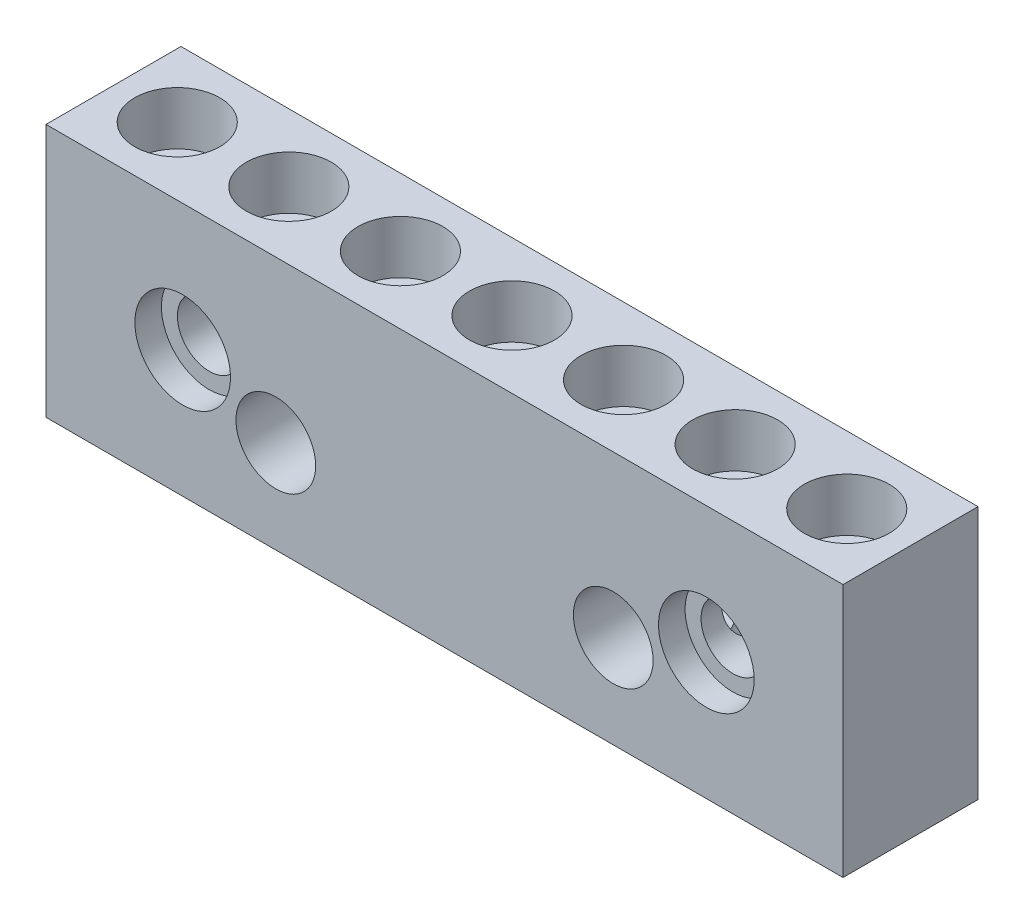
from build123d import *

# Parameters (mm, degrees)
SKETCH1_W           = 150
SKETCH1_H           = 47.75
BOSS_EXTRUDE1_DEPTH = 12.7
SKETCH3_R           = 7.5
CUT_EXTRUDE1_DEPTH  = 25.4
SKETCH4_R           = 9
CUT_EXTRUDE2_DEPTH  = 5
SKETCH5_R           = 6
CUT_EXTRUDE3_DEPTH  = 20.4
SKETCH6_R           = 8
CUT_EXTRUDE4_DEPTH  = 10
SKETCH7_R           = 4
CUT_EXTRUDE5_DEPTH  = 37.75
LPATTERN1_COUNT     = 7
LPATTERN1_PITCH     = 21


with BuildPart() as part:
    # Sketch1 → Boss-Extrude1 (new, symmetric)
    with BuildSketch(Plane.XY):
        Rectangle(SKETCH1_W, SKETCH1_H)
    extrude(amount=BOSS_EXTRUDE1_DEPTH, both=True)

    # Sketch3 → Cut-Extrude1 (cut)
    with BuildSketch(Plane.XY.offset(12.7)):
        with Locations((-31.75, -6.405)):
            Circle(SKETCH3_R)
        with Locations((31.75, -6.405)):
            Circle(SKETCH3_R)
    extrude(amount=-CUT_EXTRUDE1_DEPTH, mode=Mode.SUBTRACT)

    # Sketch4 → Cut-Extrude2 (cut)
    with BuildSketch(Plane.XY.offset(12.7)):
        with Locations((-49.275, -0.005)):
            Circle(SKETCH4_R)
        with Locations((49.275, -0.005)):
            Circle(SKETCH4_R)
    extrude(amount=-CUT_EXTRUDE2_DEPTH, mode=Mode.SUBTRACT)

    # Sketch5 → Cut-Extrude3 (cut)
    with BuildSketch(Plane.XY.offset(7.7)):
        with Locations((-49.275, -0.005)):
            Circle(SKETCH5_R)
        with Locations((49.275, -0.005)):
            Circle(SKETCH5_R)
    extrude(amount=-CUT_EXTRUDE3_DEPTH, mode=Mode.SUBTRACT)

    # Sketch6 → Cut-Extrude4 (cut)
    with BuildSketch(Plane(origin=(0, 23.875, 0), x_dir=(1, 0, 0), z_dir=(0, 1, 0))):
        with Locations(Location((-63, 0, 0), (0, 0, 180))):
            Circle(SKETCH6_R)
    cut_extrude4 = extrude(amount=-CUT_EXTRUDE4_DEPTH, mode=Mode.SUBTRACT)

    # Sketch7 → Cut-Extrude5 (cut)
    with BuildSketch(Plane(origin=(0, 13.875, 0), x_dir=(1, 0, 0), z_dir=(0, 1, 0))):
        with Locations(Location((-63, 0, 0), (0, 0, 180))):
            Circle(SKETCH7_R)
    cut_extrude5 = extrude(amount=-CUT_EXTRUDE5_DEPTH, mode=Mode.SUBTRACT)

    # LPattern1: Cut-Extrude4, Cut-Extrude5 ×7
    with Locations(*[(i * LPATTERN1_PITCH, 0, 0) for i in range(1, LPATTERN1_COUNT)]):
        add(cut_extrude4, mode=Mode.SUBTRACT)
        add(cut_extrude5, mode=Mode.SUBTRACT)


solid = part.part
